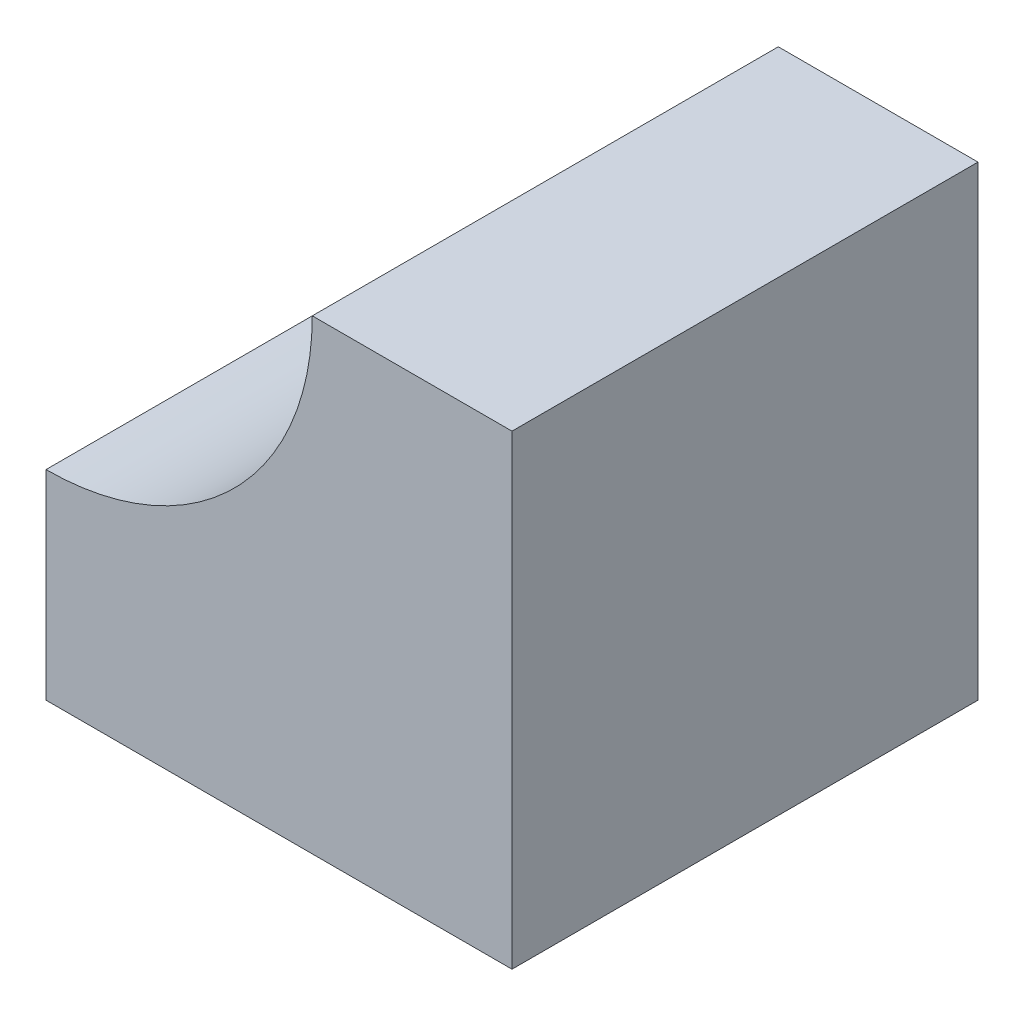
from build123d import *

# Parameters (mm, degrees)
BOSS_EXTRUDE1_DEPTH = 88.9


with BuildPart() as part:
    # Sketch1 → Boss-Extrude1 (new body)
    with BuildSketch(Plane.XY):
        with BuildLine():
            Line((44.45, 44.45), (6.35, 44.45))
            ThreePointArc((6.35, 44.45), (-8.528975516, 8.528975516), (-44.45, -6.35))
            Line((-44.45, -6.35), (-44.45, -44.45))
            Line((-44.45, -44.45), (44.45, -44.45))
            Line((44.45, -44.45), (44.45, 44.45))
        make_face()
    extrude(amount=BOSS_EXTRUDE1_DEPTH)


solid = part.part
